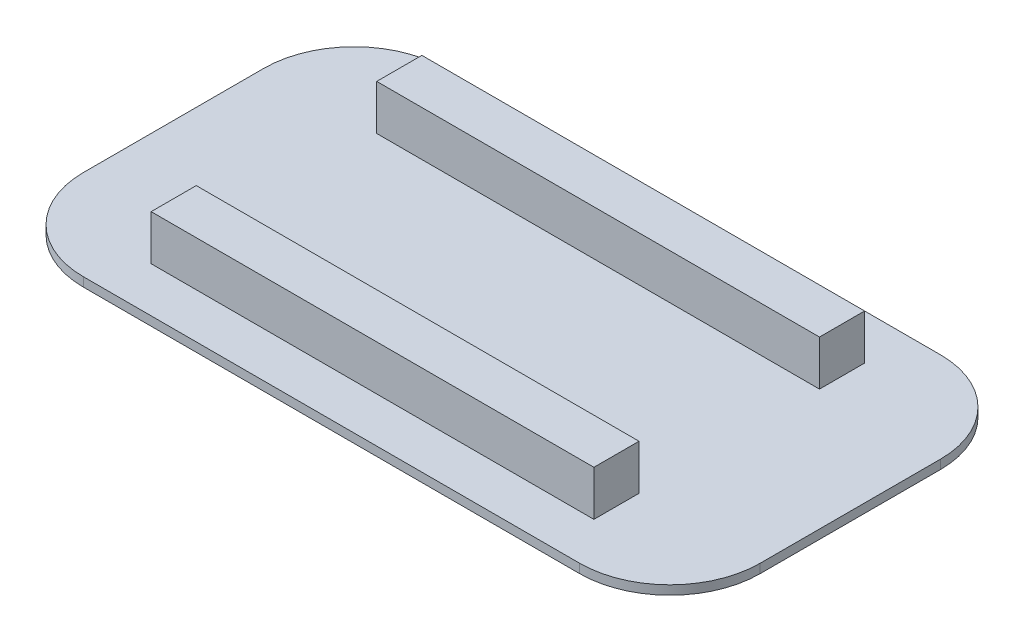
ISO-10303-21;
HEADER;
FILE_DESCRIPTION(('STEP AP214'),'2;1');
FILE_NAME('part.step','',(''),(''),'','','');
FILE_SCHEMA(('AUTOMOTIVE_DESIGN { 1 0 10303 214 1 1 1 1 }'));
ENDSEC;
DATA;
#1=APPLICATION_CONTEXT('core data for automotive mechanical design processes');
#2=APPLICATION_PROTOCOL_DEFINITION('international standard','automotive_design',2000,#1);
#3=PRODUCT_CONTEXT('',#1,'mechanical');
#4=PRODUCT('Part','Part','',(#3));
#5=PRODUCT_RELATED_PRODUCT_CATEGORY('part','',(#4));
#6=PRODUCT_DEFINITION_FORMATION('','',#4);
#7=PRODUCT_DEFINITION_CONTEXT('part definition',#1,'design');
#8=PRODUCT_DEFINITION('design','',#6,#7);
#9=PRODUCT_DEFINITION_SHAPE('','',#8);
#10=(LENGTH_UNIT() NAMED_UNIT(*) SI_UNIT(.MILLI.,.METRE.));
#11=(NAMED_UNIT(*) PLANE_ANGLE_UNIT() SI_UNIT($,.RADIAN.));
#12=(NAMED_UNIT(*) SI_UNIT($,.STERADIAN.) SOLID_ANGLE_UNIT());
#13=UNCERTAINTY_MEASURE_WITH_UNIT(LENGTH_MEASURE(1.E-05),#10,'distance_accuracy_value','');
#14=(GEOMETRIC_REPRESENTATION_CONTEXT(3) GLOBAL_UNCERTAINTY_ASSIGNED_CONTEXT((#13)) GLOBAL_UNIT_ASSIGNED_CONTEXT((#10,
#11,#12)) REPRESENTATION_CONTEXT('',''));
#15=CARTESIAN_POINT('',(0.,0.,0.));
#16=DIRECTION('',(0.,0.,1.));
#17=DIRECTION('',(1.,0.,0.));
#18=AXIS2_PLACEMENT_3D('',#15,#16,#17);
#19=CARTESIAN_POINT('',(0.,1.,0.));
#20=DIRECTION('',(0.,-1.,0.));
#21=DIRECTION('',(0.,0.,-1.));
#22=AXIS2_PLACEMENT_3D('',#19,#20,#21);
#23=PLANE('',#22);
#24=DIRECTION('',(0.,0.,-1.));
#25=VECTOR('',#24,1.);
#26=CARTESIAN_POINT('',(24.0764075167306,1.,15.));
#27=LINE('',#26,#25);
#28=CARTESIAN_POINT('',(24.0764075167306,1.,15.));
#29=VERTEX_POINT('',#28);
#30=CARTESIAN_POINT('',(24.0764075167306,1.,10.));
#31=VERTEX_POINT('',#30);
#32=EDGE_CURVE('E166',#29,#31,#27,.T.);
#33=ORIENTED_EDGE('',*,*,#32,.F.);
#34=DIRECTION('',(1.,0.,0.));
#35=VECTOR('',#34,1.);
#36=CARTESIAN_POINT('',(24.0764075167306,1.,15.));
#37=LINE('',#36,#35);
#38=CARTESIAN_POINT('',(-24.9912164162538,1.,15.));
#39=VERTEX_POINT('',#38);
#40=EDGE_CURVE('E179',#39,#29,#37,.T.);
#41=ORIENTED_EDGE('',*,*,#40,.F.);
#42=DIRECTION('',(0.,0.,1.));
#43=VECTOR('',#42,1.);
#44=CARTESIAN_POINT('',(-24.9912164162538,1.,15.));
#45=LINE('',#44,#43);
#46=CARTESIAN_POINT('',(-24.9912164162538,1.,10.));
#47=VERTEX_POINT('',#46);
#48=EDGE_CURVE('E188',#47,#39,#45,.T.);
#49=ORIENTED_EDGE('',*,*,#48,.F.);
#50=DIRECTION('',(-1.,0.,0.));
#51=VECTOR('',#50,1.);
#52=CARTESIAN_POINT('',(24.0764075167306,1.,10.));
#53=LINE('',#52,#51);
#54=EDGE_CURVE('E169',#31,#47,#53,.T.);
#55=ORIENTED_EDGE('',*,*,#54,.F.);
#56=EDGE_LOOP('',(#33,#41,#49,#55));
#57=FACE_BOUND('',#56,.T.);
#58=DIRECTION('',(-1.,0.,0.));
#59=VECTOR('',#58,1.);
#60=CARTESIAN_POINT('',(-37.5,1.,-20.));
#61=LINE('',#60,#59);
#62=CARTESIAN_POINT('',(27.5,1.,-20.));
#63=VERTEX_POINT('',#62);
#64=CARTESIAN_POINT('',(-27.5,1.,-20.));
#65=VERTEX_POINT('',#64);
#66=EDGE_CURVE('E215',#63,#65,#61,.T.);
#67=ORIENTED_EDGE('',*,*,#66,.T.);
#68=CARTESIAN_POINT('',(-27.5,1.,-10.));
#69=DIRECTION('',(0.,-1.,0.));
#70=DIRECTION('',(0.,0.,-1.));
#71=AXIS2_PLACEMENT_3D('',#68,#69,#70);
#72=CIRCLE('',#71,10.);
#73=CARTESIAN_POINT('',(-37.5,1.,-10.));
#74=VERTEX_POINT('',#73);
#75=EDGE_CURVE('E252',#65,#74,#72,.F.);
#76=ORIENTED_EDGE('',*,*,#75,.T.);
#77=DIRECTION('',(0.,0.,1.));
#78=VECTOR('',#77,1.);
#79=CARTESIAN_POINT('',(-37.5,1.,20.));
#80=LINE('',#79,#78);
#81=CARTESIAN_POINT('',(-37.5,1.,10.));
#82=VERTEX_POINT('',#81);
#83=EDGE_CURVE('E205',#74,#82,#80,.T.);
#84=ORIENTED_EDGE('',*,*,#83,.T.);
#85=CARTESIAN_POINT('',(-27.5,1.,10.));
#86=DIRECTION('',(0.,-1.,0.));
#87=DIRECTION('',(0.,0.,-1.));
#88=AXIS2_PLACEMENT_3D('',#85,#86,#87);
#89=CIRCLE('',#88,10.);
#90=CARTESIAN_POINT('',(-27.5,1.,20.));
#91=VERTEX_POINT('',#90);
#92=EDGE_CURVE('E246',#82,#91,#89,.F.);
#93=ORIENTED_EDGE('',*,*,#92,.T.);
#94=DIRECTION('',(1.,0.,0.));
#95=VECTOR('',#94,1.);
#96=CARTESIAN_POINT('',(-37.5,1.,20.));
#97=LINE('',#96,#95);
#98=CARTESIAN_POINT('',(27.5,1.,20.));
#99=VERTEX_POINT('',#98);
#100=EDGE_CURVE('E208',#91,#99,#97,.T.);
#101=ORIENTED_EDGE('',*,*,#100,.T.);
#102=CARTESIAN_POINT('',(27.5,1.,10.));
#103=DIRECTION('',(0.,-1.,0.));
#104=DIRECTION('',(0.,0.,-1.));
#105=AXIS2_PLACEMENT_3D('',#102,#103,#104);
#106=CIRCLE('',#105,10.);
#107=CARTESIAN_POINT('',(37.5,1.,10.));
#108=VERTEX_POINT('',#107);
#109=EDGE_CURVE('E248',#99,#108,#106,.F.);
#110=ORIENTED_EDGE('',*,*,#109,.T.);
#111=DIRECTION('',(0.,0.,-1.));
#112=VECTOR('',#111,1.);
#113=CARTESIAN_POINT('',(37.5,1.,20.));
#114=LINE('',#113,#112);
#115=CARTESIAN_POINT('',(37.5,1.,-10.));
#116=VERTEX_POINT('',#115);
#117=EDGE_CURVE('E212',#108,#116,#114,.T.);
#118=ORIENTED_EDGE('',*,*,#117,.T.);
#119=CARTESIAN_POINT('',(27.5,1.,-10.));
#120=DIRECTION('',(0.,-1.,0.));
#121=DIRECTION('',(0.,0.,-1.));
#122=AXIS2_PLACEMENT_3D('',#119,#120,#121);
#123=CIRCLE('',#122,10.);
#124=EDGE_CURVE('E250',#116,#63,#123,.F.);
#125=ORIENTED_EDGE('',*,*,#124,.T.);
#126=EDGE_LOOP('',(#67,#76,#84,#93,#101,#110,#118,#125));
#127=FACE_BOUND('',#126,.T.);
#128=DIRECTION('',(0.,0.,-1.));
#129=VECTOR('',#128,1.);
#130=CARTESIAN_POINT('',(24.0764075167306,1.,-10.));
#131=LINE('',#130,#129);
#132=CARTESIAN_POINT('',(24.0764075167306,1.,-10.));
#133=VERTEX_POINT('',#132);
#134=CARTESIAN_POINT('',(24.0764075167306,1.,-15.));
#135=VERTEX_POINT('',#134);
#136=EDGE_CURVE('E165',#133,#135,#131,.T.);
#137=ORIENTED_EDGE('',*,*,#136,.F.);
#138=DIRECTION('',(1.,0.,0.));
#139=VECTOR('',#138,1.);
#140=CARTESIAN_POINT('',(24.0764075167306,1.,-10.));
#141=LINE('',#140,#139);
#142=CARTESIAN_POINT('',(-24.9912164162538,1.,-9.99999999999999));
#143=VERTEX_POINT('',#142);
#144=EDGE_CURVE('E162',#143,#133,#141,.T.);
#145=ORIENTED_EDGE('',*,*,#144,.F.);
#146=DIRECTION('',(0.,0.,1.));
#147=VECTOR('',#146,1.);
#148=CARTESIAN_POINT('',(-24.9912164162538,1.,-9.99999999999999));
#149=LINE('',#148,#147);
#150=CARTESIAN_POINT('',(-24.9912164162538,1.,-15.));
#151=VERTEX_POINT('',#150);
#152=EDGE_CURVE('E53',#151,#143,#149,.T.);
#153=ORIENTED_EDGE('',*,*,#152,.F.);
#154=DIRECTION('',(-1.,0.,0.));
#155=VECTOR('',#154,1.);
#156=CARTESIAN_POINT('',(24.0764075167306,1.,-15.));
#157=LINE('',#156,#155);
#158=EDGE_CURVE('E48',#135,#151,#157,.T.);
#159=ORIENTED_EDGE('',*,*,#158,.F.);
#160=EDGE_LOOP('',(#137,#145,#153,#159));
#161=FACE_BOUND('',#160,.T.);
#162=ADVANCED_FACE('F33',(#57,#127,#161),#23,.F.);
#163=CARTESIAN_POINT('',(-37.5,1.,20.));
#164=DIRECTION('',(1.,0.,0.));
#165=DIRECTION('',(0.,0.,-1.));
#166=AXIS2_PLACEMENT_3D('',#163,#164,#165);
#167=PLANE('',#166);
#168=ORIENTED_EDGE('',*,*,#83,.F.);
#169=DIRECTION('',(0.,-1.,0.));
#170=VECTOR('',#169,1.);
#171=CARTESIAN_POINT('',(-37.5,1.,-10.));
#172=LINE('',#171,#170);
#173=CARTESIAN_POINT('',(-37.5,0.,-10.));
#174=VERTEX_POINT('',#173);
#175=EDGE_CURVE('E230',#74,#174,#172,.T.);
#176=ORIENTED_EDGE('',*,*,#175,.T.);
#177=DIRECTION('',(0.,0.,1.));
#178=VECTOR('',#177,1.);
#179=CARTESIAN_POINT('',(-37.5,0.,20.));
#180=LINE('',#179,#178);
#181=CARTESIAN_POINT('',(-37.5,0.,10.));
#182=VERTEX_POINT('',#181);
#183=EDGE_CURVE('E204',#174,#182,#180,.T.);
#184=ORIENTED_EDGE('',*,*,#183,.T.);
#185=DIRECTION('',(0.,-1.,0.));
#186=VECTOR('',#185,1.);
#187=CARTESIAN_POINT('',(-37.5,1.,10.));
#188=LINE('',#187,#186);
#189=EDGE_CURVE('E218',#182,#82,#188,.F.);
#190=ORIENTED_EDGE('',*,*,#189,.T.);
#191=EDGE_LOOP('',(#168,#176,#184,#190));
#192=FACE_BOUND('',#191,.T.);
#193=ADVANCED_FACE('F295',(#192),#167,.F.);
#194=CARTESIAN_POINT('',(-37.5,1.,20.));
#195=DIRECTION('',(0.,0.,-1.));
#196=DIRECTION('',(-1.,0.,0.));
#197=AXIS2_PLACEMENT_3D('',#194,#195,#196);
#198=PLANE('',#197);
#199=DIRECTION('',(1.,0.,0.));
#200=VECTOR('',#199,1.);
#201=CARTESIAN_POINT('',(-37.5,0.,20.));
#202=LINE('',#201,#200);
#203=CARTESIAN_POINT('',(-27.5,0.,20.));
#204=VERTEX_POINT('',#203);
#205=CARTESIAN_POINT('',(27.5,0.,20.));
#206=VERTEX_POINT('',#205);
#207=EDGE_CURVE('E221',#204,#206,#202,.T.);
#208=ORIENTED_EDGE('',*,*,#207,.T.);
#209=DIRECTION('',(0.,-1.,0.));
#210=VECTOR('',#209,1.);
#211=CARTESIAN_POINT('',(27.5,1.,20.));
#212=LINE('',#211,#210);
#213=EDGE_CURVE('E11',#206,#99,#212,.F.);
#214=ORIENTED_EDGE('',*,*,#213,.T.);
#215=ORIENTED_EDGE('',*,*,#100,.F.);
#216=DIRECTION('',(0.,-1.,0.));
#217=VECTOR('',#216,1.);
#218=CARTESIAN_POINT('',(-27.5,1.,20.));
#219=LINE('',#218,#217);
#220=EDGE_CURVE('E41',#91,#204,#219,.T.);
#221=ORIENTED_EDGE('',*,*,#220,.T.);
#222=EDGE_LOOP('',(#208,#214,#215,#221));
#223=FACE_BOUND('',#222,.T.);
#224=ADVANCED_FACE('F263',(#223),#198,.F.);
#225=CARTESIAN_POINT('',(37.5,1.,20.));
#226=DIRECTION('',(-1.,0.,0.));
#227=DIRECTION('',(0.,0.,1.));
#228=AXIS2_PLACEMENT_3D('',#225,#226,#227);
#229=PLANE('',#228);
#230=DIRECTION('',(0.,0.,-1.));
#231=VECTOR('',#230,1.);
#232=CARTESIAN_POINT('',(37.5,0.,20.));
#233=LINE('',#232,#231);
#234=CARTESIAN_POINT('',(37.5,0.,10.));
#235=VERTEX_POINT('',#234);
#236=CARTESIAN_POINT('',(37.5,0.,-10.));
#237=VERTEX_POINT('',#236);
#238=EDGE_CURVE('E224',#235,#237,#233,.T.);
#239=ORIENTED_EDGE('',*,*,#238,.T.);
#240=DIRECTION('',(0.,-1.,0.));
#241=VECTOR('',#240,1.);
#242=CARTESIAN_POINT('',(37.5,1.,-10.));
#243=LINE('',#242,#241);
#244=EDGE_CURVE('E257',#237,#116,#243,.F.);
#245=ORIENTED_EDGE('',*,*,#244,.T.);
#246=ORIENTED_EDGE('',*,*,#117,.F.);
#247=DIRECTION('',(0.,-1.,0.));
#248=VECTOR('',#247,1.);
#249=CARTESIAN_POINT('',(37.5,1.,10.));
#250=LINE('',#249,#248);
#251=EDGE_CURVE('E254',#108,#235,#250,.T.);
#252=ORIENTED_EDGE('',*,*,#251,.T.);
#253=EDGE_LOOP('',(#239,#245,#246,#252));
#254=FACE_BOUND('',#253,.T.);
#255=ADVANCED_FACE('F277',(#254),#229,.F.);
#256=CARTESIAN_POINT('',(-37.5,1.,-20.));
#257=DIRECTION('',(0.,0.,1.));
#258=DIRECTION('',(1.,0.,0.));
#259=AXIS2_PLACEMENT_3D('',#256,#257,#258);
#260=PLANE('',#259);
#261=DIRECTION('',(-1.,0.,0.));
#262=VECTOR('',#261,1.);
#263=CARTESIAN_POINT('',(-37.5,0.,-20.));
#264=LINE('',#263,#262);
#265=CARTESIAN_POINT('',(27.5,0.,-20.));
#266=VERTEX_POINT('',#265);
#267=CARTESIAN_POINT('',(-27.5,0.,-20.));
#268=VERTEX_POINT('',#267);
#269=EDGE_CURVE('E209',#266,#268,#264,.T.);
#270=ORIENTED_EDGE('',*,*,#269,.T.);
#271=DIRECTION('',(0.,-1.,0.));
#272=VECTOR('',#271,1.);
#273=CARTESIAN_POINT('',(-27.5,1.,-20.));
#274=LINE('',#273,#272);
#275=EDGE_CURVE('E244',#268,#65,#274,.F.);
#276=ORIENTED_EDGE('',*,*,#275,.T.);
#277=ORIENTED_EDGE('',*,*,#66,.F.);
#278=DIRECTION('',(0.,-1.,0.));
#279=VECTOR('',#278,1.);
#280=CARTESIAN_POINT('',(27.5,1.,-20.));
#281=LINE('',#280,#279);
#282=EDGE_CURVE('E241',#63,#266,#281,.T.);
#283=ORIENTED_EDGE('',*,*,#282,.T.);
#284=EDGE_LOOP('',(#270,#276,#277,#283));
#285=FACE_BOUND('',#284,.T.);
#286=ADVANCED_FACE('F287',(#285),#260,.F.);
#287=CARTESIAN_POINT('',(0.,0.,0.));
#288=DIRECTION('',(0.,-1.,0.));
#289=DIRECTION('',(0.,0.,-1.));
#290=AXIS2_PLACEMENT_3D('',#287,#288,#289);
#291=PLANE('',#290);
#292=ORIENTED_EDGE('',*,*,#183,.F.);
#293=CARTESIAN_POINT('',(-27.5,0.,-10.));
#294=DIRECTION('',(0.,-1.,0.));
#295=DIRECTION('',(0.,0.,-1.));
#296=AXIS2_PLACEMENT_3D('',#293,#294,#295);
#297=CIRCLE('',#296,10.);
#298=EDGE_CURVE('E239',#174,#268,#297,.T.);
#299=ORIENTED_EDGE('',*,*,#298,.T.);
#300=ORIENTED_EDGE('',*,*,#269,.F.);
#301=CARTESIAN_POINT('',(27.5,0.,-10.));
#302=DIRECTION('',(0.,-1.,0.));
#303=DIRECTION('',(0.,0.,-1.));
#304=AXIS2_PLACEMENT_3D('',#301,#302,#303);
#305=CIRCLE('',#304,10.);
#306=EDGE_CURVE('E237',#266,#237,#305,.T.);
#307=ORIENTED_EDGE('',*,*,#306,.T.);
#308=ORIENTED_EDGE('',*,*,#238,.F.);
#309=CARTESIAN_POINT('',(27.5,0.,10.));
#310=DIRECTION('',(0.,-1.,0.));
#311=DIRECTION('',(0.,0.,-1.));
#312=AXIS2_PLACEMENT_3D('',#309,#310,#311);
#313=CIRCLE('',#312,10.);
#314=EDGE_CURVE('E235',#235,#206,#313,.T.);
#315=ORIENTED_EDGE('',*,*,#314,.T.);
#316=ORIENTED_EDGE('',*,*,#207,.F.);
#317=CARTESIAN_POINT('',(-27.5,0.,10.));
#318=DIRECTION('',(0.,-1.,0.));
#319=DIRECTION('',(0.,0.,-1.));
#320=AXIS2_PLACEMENT_3D('',#317,#318,#319);
#321=CIRCLE('',#320,10.);
#322=EDGE_CURVE('E233',#204,#182,#321,.T.);
#323=ORIENTED_EDGE('',*,*,#322,.T.);
#324=EDGE_LOOP('',(#292,#299,#300,#307,#308,#315,#316,#323));
#325=FACE_BOUND('',#324,.T.);
#326=ADVANCED_FACE('F269',(#325),#291,.T.);
#327=CARTESIAN_POINT('',(-27.5,1.,-10.));
#328=DIRECTION('',(0.,-1.,0.));
#329=DIRECTION('',(0.,0.,-1.));
#330=AXIS2_PLACEMENT_3D('',#327,#328,#329);
#331=CYLINDRICAL_SURFACE('',#330,10.);
#332=ORIENTED_EDGE('',*,*,#75,.F.);
#333=ORIENTED_EDGE('',*,*,#275,.F.);
#334=ORIENTED_EDGE('',*,*,#298,.F.);
#335=ORIENTED_EDGE('',*,*,#175,.F.);
#336=EDGE_LOOP('',(#332,#333,#334,#335));
#337=FACE_BOUND('',#336,.T.);
#338=ADVANCED_FACE('F292',(#337),#331,.T.);
#339=CARTESIAN_POINT('',(27.5,1.,-10.));
#340=DIRECTION('',(0.,-1.,0.));
#341=DIRECTION('',(0.,0.,-1.));
#342=AXIS2_PLACEMENT_3D('',#339,#340,#341);
#343=CYLINDRICAL_SURFACE('',#342,10.);
#344=ORIENTED_EDGE('',*,*,#124,.F.);
#345=ORIENTED_EDGE('',*,*,#244,.F.);
#346=ORIENTED_EDGE('',*,*,#306,.F.);
#347=ORIENTED_EDGE('',*,*,#282,.F.);
#348=EDGE_LOOP('',(#344,#345,#346,#347));
#349=FACE_BOUND('',#348,.T.);
#350=ADVANCED_FACE('F284',(#349),#343,.T.);
#351=CARTESIAN_POINT('',(27.5,1.,10.));
#352=DIRECTION('',(0.,-1.,0.));
#353=DIRECTION('',(0.,0.,-1.));
#354=AXIS2_PLACEMENT_3D('',#351,#352,#353);
#355=CYLINDRICAL_SURFACE('',#354,10.);
#356=ORIENTED_EDGE('',*,*,#109,.F.);
#357=ORIENTED_EDGE('',*,*,#213,.F.);
#358=ORIENTED_EDGE('',*,*,#314,.F.);
#359=ORIENTED_EDGE('',*,*,#251,.F.);
#360=EDGE_LOOP('',(#356,#357,#358,#359));
#361=FACE_BOUND('',#360,.T.);
#362=ADVANCED_FACE('F274',(#361),#355,.T.);
#363=CARTESIAN_POINT('',(-27.5,1.,10.));
#364=DIRECTION('',(0.,-1.,0.));
#365=DIRECTION('',(0.,0.,-1.));
#366=AXIS2_PLACEMENT_3D('',#363,#364,#365);
#367=CYLINDRICAL_SURFACE('',#366,10.);
#368=ORIENTED_EDGE('',*,*,#92,.F.);
#369=ORIENTED_EDGE('',*,*,#189,.F.);
#370=ORIENTED_EDGE('',*,*,#322,.F.);
#371=ORIENTED_EDGE('',*,*,#220,.F.);
#372=EDGE_LOOP('',(#368,#369,#370,#371));
#373=FACE_BOUND('',#372,.T.);
#374=ADVANCED_FACE('F35',(#373),#367,.T.);
#375=CARTESIAN_POINT('',(24.0764075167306,6.,15.));
#376=DIRECTION('',(-1.,0.,0.));
#377=DIRECTION('',(0.,0.,1.));
#378=AXIS2_PLACEMENT_3D('',#375,#376,#377);
#379=PLANE('',#378);
#380=ORIENTED_EDGE('',*,*,#32,.T.);
#381=DIRECTION('',(0.,-1.,0.));
#382=VECTOR('',#381,1.);
#383=CARTESIAN_POINT('',(24.0764075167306,6.,10.));
#384=LINE('',#383,#382);
#385=CARTESIAN_POINT('',(24.0764075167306,6.,10.));
#386=VERTEX_POINT('',#385);
#387=EDGE_CURVE('E201',#386,#31,#384,.T.);
#388=ORIENTED_EDGE('',*,*,#387,.F.);
#389=DIRECTION('',(0.,0.,-1.));
#390=VECTOR('',#389,1.);
#391=CARTESIAN_POINT('',(24.0764075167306,6.,15.));
#392=LINE('',#391,#390);
#393=CARTESIAN_POINT('',(24.0764075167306,6.,15.));
#394=VERTEX_POINT('',#393);
#395=EDGE_CURVE('E175',#394,#386,#392,.T.);
#396=ORIENTED_EDGE('',*,*,#395,.F.);
#397=DIRECTION('',(0.,-1.,0.));
#398=VECTOR('',#397,1.);
#399=CARTESIAN_POINT('',(24.0764075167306,6.,15.));
#400=LINE('',#399,#398);
#401=EDGE_CURVE('E184',#394,#29,#400,.T.);
#402=ORIENTED_EDGE('',*,*,#401,.T.);
#403=EDGE_LOOP('',(#380,#388,#396,#402));
#404=FACE_BOUND('',#403,.T.);
#405=ADVANCED_FACE('F298',(#404),#379,.F.);
#406=CARTESIAN_POINT('',(24.0764075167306,6.,10.));
#407=DIRECTION('',(0.,0.,1.));
#408=DIRECTION('',(1.,0.,0.));
#409=AXIS2_PLACEMENT_3D('',#406,#407,#408);
#410=PLANE('',#409);
#411=ORIENTED_EDGE('',*,*,#54,.T.);
#412=DIRECTION('',(0.,-1.,0.));
#413=VECTOR('',#412,1.);
#414=CARTESIAN_POINT('',(-24.9912164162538,6.,10.));
#415=LINE('',#414,#413);
#416=CARTESIAN_POINT('',(-24.9912164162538,6.,10.));
#417=VERTEX_POINT('',#416);
#418=EDGE_CURVE('E198',#417,#47,#415,.T.);
#419=ORIENTED_EDGE('',*,*,#418,.F.);
#420=DIRECTION('',(-1.,0.,0.));
#421=VECTOR('',#420,1.);
#422=CARTESIAN_POINT('',(24.0764075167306,6.,10.));
#423=LINE('',#422,#421);
#424=EDGE_CURVE('E178',#386,#417,#423,.T.);
#425=ORIENTED_EDGE('',*,*,#424,.F.);
#426=ORIENTED_EDGE('',*,*,#387,.T.);
#427=EDGE_LOOP('',(#411,#419,#425,#426));
#428=FACE_BOUND('',#427,.T.);
#429=ADVANCED_FACE('F303',(#428),#410,.F.);
#430=CARTESIAN_POINT('',(-24.9912164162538,6.,15.));
#431=DIRECTION('',(1.,0.,0.));
#432=DIRECTION('',(0.,0.,-1.));
#433=AXIS2_PLACEMENT_3D('',#430,#431,#432);
#434=PLANE('',#433);
#435=ORIENTED_EDGE('',*,*,#48,.T.);
#436=DIRECTION('',(0.,-1.,0.));
#437=VECTOR('',#436,1.);
#438=CARTESIAN_POINT('',(-24.9912164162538,6.,15.));
#439=LINE('',#438,#437);
#440=CARTESIAN_POINT('',(-24.9912164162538,6.,15.));
#441=VERTEX_POINT('',#440);
#442=EDGE_CURVE('E195',#441,#39,#439,.T.);
#443=ORIENTED_EDGE('',*,*,#442,.F.);
#444=DIRECTION('',(0.,0.,1.));
#445=VECTOR('',#444,1.);
#446=CARTESIAN_POINT('',(-24.9912164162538,6.,15.));
#447=LINE('',#446,#445);
#448=EDGE_CURVE('E181',#417,#441,#447,.T.);
#449=ORIENTED_EDGE('',*,*,#448,.F.);
#450=ORIENTED_EDGE('',*,*,#418,.T.);
#451=EDGE_LOOP('',(#435,#443,#449,#450));
#452=FACE_BOUND('',#451,.T.);
#453=ADVANCED_FACE('F357',(#452),#434,.F.);
#454=CARTESIAN_POINT('',(24.0764075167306,6.,15.));
#455=DIRECTION('',(0.,0.,-1.));
#456=DIRECTION('',(-1.,0.,0.));
#457=AXIS2_PLACEMENT_3D('',#454,#455,#456);
#458=PLANE('',#457);
#459=ORIENTED_EDGE('',*,*,#40,.T.);
#460=ORIENTED_EDGE('',*,*,#401,.F.);
#461=DIRECTION('',(1.,0.,0.));
#462=VECTOR('',#461,1.);
#463=CARTESIAN_POINT('',(24.0764075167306,6.,15.));
#464=LINE('',#463,#462);
#465=EDGE_CURVE('E183',#441,#394,#464,.T.);
#466=ORIENTED_EDGE('',*,*,#465,.F.);
#467=ORIENTED_EDGE('',*,*,#442,.T.);
#468=EDGE_LOOP('',(#459,#460,#466,#467));
#469=FACE_BOUND('',#468,.T.);
#470=ADVANCED_FACE('F366',(#469),#458,.F.);
#471=CARTESIAN_POINT('',(0.,6.,0.));
#472=DIRECTION('',(0.,1.,0.));
#473=DIRECTION('',(0.,0.,1.));
#474=AXIS2_PLACEMENT_3D('',#471,#472,#473);
#475=PLANE('',#474);
#476=ORIENTED_EDGE('',*,*,#395,.T.);
#477=ORIENTED_EDGE('',*,*,#424,.T.);
#478=ORIENTED_EDGE('',*,*,#448,.T.);
#479=ORIENTED_EDGE('',*,*,#465,.T.);
#480=EDGE_LOOP('',(#476,#477,#478,#479));
#481=FACE_BOUND('',#480,.T.);
#482=ADVANCED_FACE('F376',(#481),#475,.T.);
#483=CARTESIAN_POINT('',(24.0764075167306,6.,-10.));
#484=DIRECTION('',(-1.,0.,0.));
#485=DIRECTION('',(0.,0.,1.));
#486=AXIS2_PLACEMENT_3D('',#483,#484,#485);
#487=PLANE('',#486);
#488=ORIENTED_EDGE('',*,*,#136,.T.);
#489=DIRECTION('',(0.,-1.,0.));
#490=VECTOR('',#489,1.);
#491=CARTESIAN_POINT('',(24.0764075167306,6.,-15.));
#492=LINE('',#491,#490);
#493=CARTESIAN_POINT('',(24.0764075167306,6.,-15.));
#494=VERTEX_POINT('',#493);
#495=EDGE_CURVE('E146',#494,#135,#492,.T.);
#496=ORIENTED_EDGE('',*,*,#495,.F.);
#497=DIRECTION('',(0.,0.,-1.));
#498=VECTOR('',#497,1.);
#499=CARTESIAN_POINT('',(24.0764075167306,6.,-10.));
#500=LINE('',#499,#498);
#501=CARTESIAN_POINT('',(24.0764075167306,6.,-10.));
#502=VERTEX_POINT('',#501);
#503=EDGE_CURVE('E153',#502,#494,#500,.T.);
#504=ORIENTED_EDGE('',*,*,#503,.F.);
#505=DIRECTION('',(0.,-1.,0.));
#506=VECTOR('',#505,1.);
#507=CARTESIAN_POINT('',(24.0764075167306,6.,-10.));
#508=LINE('',#507,#506);
#509=EDGE_CURVE('E436',#502,#133,#508,.T.);
#510=ORIENTED_EDGE('',*,*,#509,.T.);
#511=EDGE_LOOP('',(#488,#496,#504,#510));
#512=FACE_BOUND('',#511,.T.);
#513=ADVANCED_FACE('F164',(#512),#487,.F.);
#514=CARTESIAN_POINT('',(24.0764075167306,6.,-15.));
#515=DIRECTION('',(0.,0.,1.));
#516=DIRECTION('',(1.,0.,0.));
#517=AXIS2_PLACEMENT_3D('',#514,#515,#516);
#518=PLANE('',#517);
#519=ORIENTED_EDGE('',*,*,#158,.T.);
#520=DIRECTION('',(0.,-1.,0.));
#521=VECTOR('',#520,1.);
#522=CARTESIAN_POINT('',(-24.9912164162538,6.,-15.));
#523=LINE('',#522,#521);
#524=CARTESIAN_POINT('',(-24.9912164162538,6.,-15.));
#525=VERTEX_POINT('',#524);
#526=EDGE_CURVE('E149',#525,#151,#523,.T.);
#527=ORIENTED_EDGE('',*,*,#526,.F.);
#528=DIRECTION('',(-1.,0.,0.));
#529=VECTOR('',#528,1.);
#530=CARTESIAN_POINT('',(24.0764075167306,6.,-15.));
#531=LINE('',#530,#529);
#532=EDGE_CURVE('E142',#494,#525,#531,.T.);
#533=ORIENTED_EDGE('',*,*,#532,.F.);
#534=ORIENTED_EDGE('',*,*,#495,.T.);
#535=EDGE_LOOP('',(#519,#527,#533,#534));
#536=FACE_BOUND('',#535,.T.);
#537=ADVANCED_FACE('F144',(#536),#518,.F.);
#538=CARTESIAN_POINT('',(-24.9912164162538,6.,-9.99999999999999));
#539=DIRECTION('',(1.,0.,0.));
#540=DIRECTION('',(0.,0.,-1.));
#541=AXIS2_PLACEMENT_3D('',#538,#539,#540);
#542=PLANE('',#541);
#543=ORIENTED_EDGE('',*,*,#152,.T.);
#544=DIRECTION('',(0.,-1.,0.));
#545=VECTOR('',#544,1.);
#546=CARTESIAN_POINT('',(-24.9912164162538,6.,-9.99999999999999));
#547=LINE('',#546,#545);
#548=CARTESIAN_POINT('',(-24.9912164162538,6.,-9.99999999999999));
#549=VERTEX_POINT('',#548);
#550=EDGE_CURVE('E171',#549,#143,#547,.T.);
#551=ORIENTED_EDGE('',*,*,#550,.F.);
#552=DIRECTION('',(0.,0.,1.));
#553=VECTOR('',#552,1.);
#554=CARTESIAN_POINT('',(-24.9912164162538,6.,-9.99999999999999));
#555=LINE('',#554,#553);
#556=EDGE_CURVE('E152',#525,#549,#555,.T.);
#557=ORIENTED_EDGE('',*,*,#556,.F.);
#558=ORIENTED_EDGE('',*,*,#526,.T.);
#559=EDGE_LOOP('',(#543,#551,#557,#558));
#560=FACE_BOUND('',#559,.T.);
#561=ADVANCED_FACE('F403',(#560),#542,.F.);
#562=CARTESIAN_POINT('',(24.0764075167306,6.,-10.));
#563=DIRECTION('',(0.,0.,-1.));
#564=DIRECTION('',(-1.,0.,0.));
#565=AXIS2_PLACEMENT_3D('',#562,#563,#564);
#566=PLANE('',#565);
#567=ORIENTED_EDGE('',*,*,#144,.T.);
#568=ORIENTED_EDGE('',*,*,#509,.F.);
#569=DIRECTION('',(1.,0.,0.));
#570=VECTOR('',#569,1.);
#571=CARTESIAN_POINT('',(24.0764075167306,6.,-10.));
#572=LINE('',#571,#570);
#573=EDGE_CURVE('E158',#549,#502,#572,.T.);
#574=ORIENTED_EDGE('',*,*,#573,.F.);
#575=ORIENTED_EDGE('',*,*,#550,.T.);
#576=EDGE_LOOP('',(#567,#568,#574,#575));
#577=FACE_BOUND('',#576,.T.);
#578=ADVANCED_FACE('F412',(#577),#566,.F.);
#579=CARTESIAN_POINT('',(0.,6.,0.));
#580=DIRECTION('',(0.,1.,0.));
#581=DIRECTION('',(0.,0.,1.));
#582=AXIS2_PLACEMENT_3D('',#579,#580,#581);
#583=PLANE('',#582);
#584=ORIENTED_EDGE('',*,*,#503,.T.);
#585=ORIENTED_EDGE('',*,*,#532,.T.);
#586=ORIENTED_EDGE('',*,*,#556,.T.);
#587=ORIENTED_EDGE('',*,*,#573,.T.);
#588=EDGE_LOOP('',(#584,#585,#586,#587));
#589=FACE_BOUND('',#588,.T.);
#590=ADVANCED_FACE('F156',(#589),#583,.T.);
#591=CLOSED_SHELL('',(#162,#193,#224,#255,#286,#326,#338,#350,#362,#374,#405,#429,#453,#470,
#482,#513,#537,#561,#578,#590));
#592=MANIFOLD_SOLID_BREP('B2',#591);
#593=ADVANCED_BREP_SHAPE_REPRESENTATION('',(#18,#592),#14);
#594=SHAPE_DEFINITION_REPRESENTATION(#9,#593);
ENDSEC;
END-ISO-10303-21;
